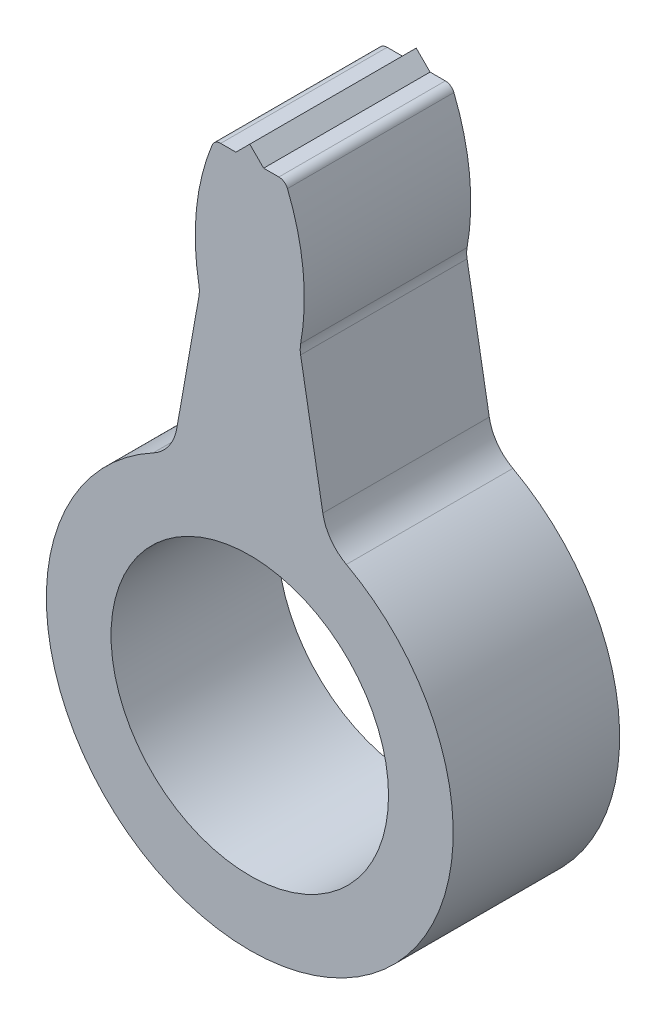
from build123d import *

# Parameters (mm, degrees)
SKIZZE1_R               = 15.005
LINEAR_AUSTRAGEN1_DEPTH = 18


with BuildPart() as part:
    # Skizze1 → Linear austragen1 (new body)
    with BuildSketch(Plane.XY):
        with BuildLine():
            Line((7.8993955, 22.89222552), (5.49860474, 36.507873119))
            ThreePointArc((5.49860474, 36.507873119), (5.453034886, 37.034972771), (5.500768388, 37.561880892))
            ThreePointArc((5.500768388, 37.561880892), (5.766650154, 44.569266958), (4.075947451, 51.374829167))
            ThreePointArc((4.075947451, 51.374829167), (3.707946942, 51.829104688), (3.148853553, 52))
            Line((3.148853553, 52), (1.5, 52))
            Line((1.5, 52), (0, 53.5))
            Line((0, 53.5), (-1.5, 52))
            Line((-1.5, 52), (-3.148853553, 52))
            ThreePointArc((-3.148853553, 52), (-3.707946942, 51.829104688), (-4.075947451, 51.374829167))
            ThreePointArc((-4.075947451, 51.374829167), (-5.766650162, 44.569266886), (-5.500768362, 37.561880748))
            ThreePointArc((-5.500768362, 37.561880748), (-5.453034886, 37.034972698), (-5.49860474, 36.507873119))
            Line((-5.49860474, 36.507873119), (-7.8993955, 22.89222552))
            ThreePointArc((-7.8993955, 22.89222552), (-8.769248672, 20.834102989), (-10.448724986, 19.360375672))
            ThreePointArc((-10.448724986, 19.360375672), (0, -22), (10.448724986, 19.360375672))
            ThreePointArc((10.448724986, 19.360375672), (8.769248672, 20.834102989), (7.8993955, 22.89222552))
        make_face()
        Circle(SKIZZE1_R, mode=Mode.SUBTRACT)
    extrude(amount=LINEAR_AUSTRAGEN1_DEPTH)


solid = part.part
